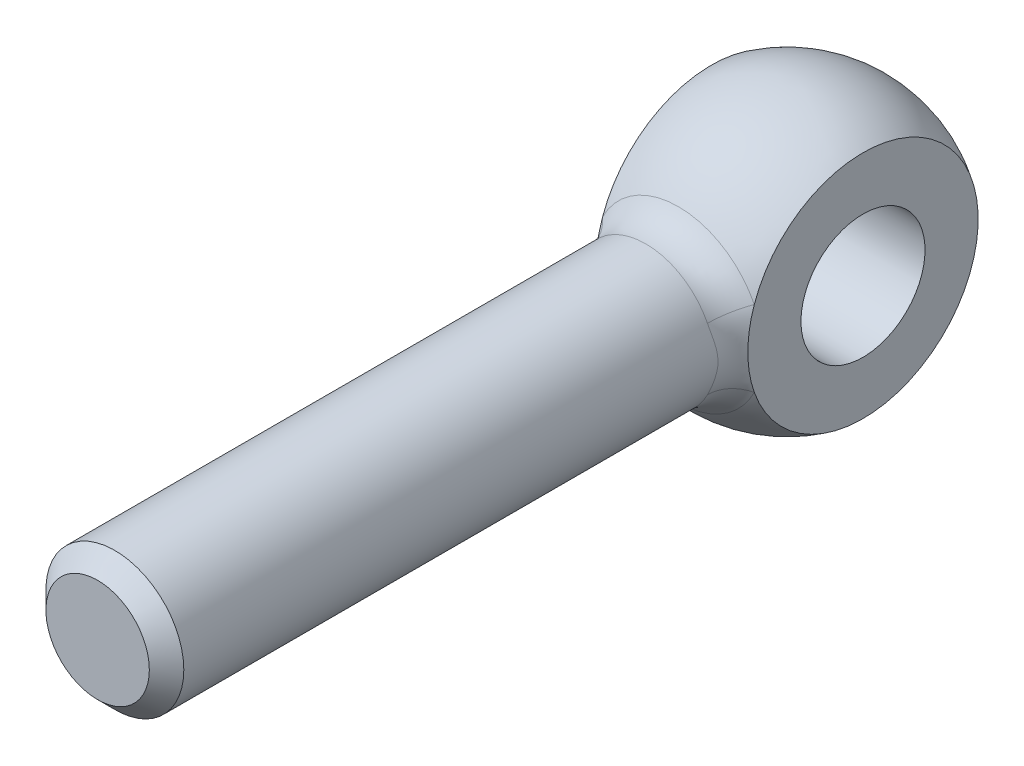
ISO-10303-21;
HEADER;
FILE_DESCRIPTION(('STEP AP214'),'2;1');
FILE_NAME('part.step','',(''),(''),'','','');
FILE_SCHEMA(('AUTOMOTIVE_DESIGN { 1 0 10303 214 1 1 1 1 }'));
ENDSEC;
DATA;
#1=APPLICATION_CONTEXT('core data for automotive mechanical design processes');
#2=APPLICATION_PROTOCOL_DEFINITION('international standard','automotive_design',2000,#1);
#3=PRODUCT_CONTEXT('',#1,'mechanical');
#4=PRODUCT('Part','Part','',(#3));
#5=PRODUCT_RELATED_PRODUCT_CATEGORY('part','',(#4));
#6=PRODUCT_DEFINITION_FORMATION('','',#4);
#7=PRODUCT_DEFINITION_CONTEXT('part definition',#1,'design');
#8=PRODUCT_DEFINITION('design','',#6,#7);
#9=PRODUCT_DEFINITION_SHAPE('','',#8);
#10=(LENGTH_UNIT() NAMED_UNIT(*) SI_UNIT(.MILLI.,.METRE.));
#11=(NAMED_UNIT(*) PLANE_ANGLE_UNIT() SI_UNIT($,.RADIAN.));
#12=(NAMED_UNIT(*) SI_UNIT($,.STERADIAN.) SOLID_ANGLE_UNIT());
#13=UNCERTAINTY_MEASURE_WITH_UNIT(LENGTH_MEASURE(1.E-05),#10,'distance_accuracy_value','');
#14=(GEOMETRIC_REPRESENTATION_CONTEXT(3) GLOBAL_UNCERTAINTY_ASSIGNED_CONTEXT((#13)) GLOBAL_UNIT_ASSIGNED_CONTEXT((#10,
#11,#12)) REPRESENTATION_CONTEXT('',''));
#15=CARTESIAN_POINT('',(0.,0.,0.));
#16=DIRECTION('',(0.,0.,1.));
#17=DIRECTION('',(1.,0.,0.));
#18=AXIS2_PLACEMENT_3D('',#15,#16,#17);
#19=CARTESIAN_POINT('',(0.,0.,0.));
#20=DIRECTION('',(-1.,0.,0.));
#21=DIRECTION('',(0.,0.,-1.));
#22=AXIS2_PLACEMENT_3D('',#19,#20,#21);
#23=SPHERICAL_SURFACE('',#22,20.);
#24=CARTESIAN_POINT('',(11.,0.,0.));
#25=DIRECTION('',(1.,0.,0.));
#26=DIRECTION('',(0.,0.,1.));
#27=AXIS2_PLACEMENT_3D('',#24,#25,#26);
#28=CIRCLE('',#27,16.70329308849);
#29=CARTESIAN_POINT('',(11.,5.52080518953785,15.7645396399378));
#30=VERTEX_POINT('',#29);
#31=CARTESIAN_POINT('',(11.,-5.52080518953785,15.7645396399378));
#32=VERTEX_POINT('',#31);
#33=EDGE_CURVE('E249',#30,#32,#28,.F.);
#34=ORIENTED_EDGE('',*,*,#33,.T.);
#35=CARTESIAN_POINT('',(0.,0.,15.7645396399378));
#36=DIRECTION('',(0.,0.,-1.));
#37=DIRECTION('',(-1.,0.,0.));
#38=AXIS2_PLACEMENT_3D('',#35,#36,#37);
#39=CIRCLE('',#38,12.3076923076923);
#40=CARTESIAN_POINT('',(-11.,-5.52080518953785,15.7645396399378));
#41=VERTEX_POINT('',#40);
#42=EDGE_CURVE('E72',#32,#41,#39,.T.);
#43=ORIENTED_EDGE('',*,*,#42,.T.);
#44=CARTESIAN_POINT('',(-11.,0.,0.));
#45=DIRECTION('',(1.,0.,0.));
#46=DIRECTION('',(0.,0.,1.));
#47=AXIS2_PLACEMENT_3D('',#44,#45,#46);
#48=CIRCLE('',#47,16.70329308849);
#49=CARTESIAN_POINT('',(-11.,5.52080518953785,15.7645396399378));
#50=VERTEX_POINT('',#49);
#51=EDGE_CURVE('E60',#50,#41,#48,.F.);
#52=ORIENTED_EDGE('',*,*,#51,.F.);
#53=CARTESIAN_POINT('',(0.,0.,15.7645396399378));
#54=DIRECTION('',(0.,0.,-1.));
#55=DIRECTION('',(-1.,0.,0.));
#56=AXIS2_PLACEMENT_3D('',#53,#54,#55);
#57=CIRCLE('',#56,12.3076923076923);
#58=EDGE_CURVE('E69',#50,#30,#57,.T.);
#59=ORIENTED_EDGE('',*,*,#58,.T.);
#60=EDGE_LOOP('',(#34,#43,#52,#59));
#61=FACE_BOUND('',#60,.T.);
#62=ADVANCED_FACE('F14',(#61),#23,.T.);
#63=CARTESIAN_POINT('',(0.,0.,-10.));
#64=DIRECTION('',(0.,0.,-1.));
#65=DIRECTION('',(1.,0.,0.));
#66=AXIS2_PLACEMENT_3D('',#63,#64,#65);
#67=CYLINDRICAL_SURFACE('',#66,10.);
#68=CARTESIAN_POINT('',(11.,8.07832617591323,14.6198716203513));
#69=CARTESIAN_POINT('',(8.08765754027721,5.99719772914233,16.1346741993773));
#70=CARTESIAN_POINT('',(7.28375150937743,6.85178545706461,19.8401938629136));
#71=CARTESIAN_POINT('',(11.,7.94371142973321,14.6942392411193));
#72=CARTESIAN_POINT('',(8.11920288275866,5.93544807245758,16.2397825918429));
#73=CARTESIAN_POINT('',(7.39683409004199,6.73162150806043,19.9238227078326));
#74=CARTESIAN_POINT('',(11.,7.80678494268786,14.7674864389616));
#75=CARTESIAN_POINT('',(8.15519367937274,5.8698319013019,16.3423149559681));
#76=CARTESIAN_POINT('',(7.50807818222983,6.60735770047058,19.9985173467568));
#77=CARTESIAN_POINT('',(11.,7.52777859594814,14.9116503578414));
#78=CARTESIAN_POINT('',(8.23492168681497,5.72986071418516,16.5404699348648));
#79=CARTESIAN_POINT('',(7.72578328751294,6.35140245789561,20.1309394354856));
#80=CARTESIAN_POINT('',(11.,7.38570047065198,14.9825678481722));
#81=CARTESIAN_POINT('',(8.27858235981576,5.65560014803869,16.6361171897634));
#82=CARTESIAN_POINT('',(7.83224588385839,6.21971351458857,20.1886725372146));
#83=CARTESIAN_POINT('',(11.,7.09641260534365,15.1217242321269));
#84=CARTESIAN_POINT('',(8.37244720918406,5.4973859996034,16.8193360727));
#85=CARTESIAN_POINT('',(8.03890108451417,5.95019585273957,20.2879075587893));
#86=CARTESIAN_POINT('',(11.,6.94922832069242,15.1899735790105));
#87=CARTESIAN_POINT('',(8.42255486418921,5.41357855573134,16.9069775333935));
#88=CARTESIAN_POINT('',(8.1391193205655,5.81239684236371,20.3294800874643));
#89=CARTESIAN_POINT('',(11.,6.64863682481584,15.3239259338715));
#90=CARTESIAN_POINT('',(8.52797993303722,5.23504745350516,17.0738797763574));
#91=CARTESIAN_POINT('',(8.33295854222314,5.53091179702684,20.3979224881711));
#92=CARTESIAN_POINT('',(11.,6.49523086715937,15.3896294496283));
#93=CARTESIAN_POINT('',(8.58324700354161,5.14042645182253,17.1531990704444));
#94=CARTESIAN_POINT('',(8.42658084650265,5.38722694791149,20.4247953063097));
#95=CARTESIAN_POINT('',(11.,6.20709411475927,15.5078088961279));
#96=CARTESIAN_POINT('',(8.68811994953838,4.95575537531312,17.2908288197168));
#97=CARTESIAN_POINT('',(8.59200338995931,5.11841729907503,20.4619167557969));
#98=CARTESIAN_POINT('',(11.,6.07336532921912,15.5607030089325));
#99=CARTESIAN_POINT('',(8.73711538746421,4.86761224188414,17.3504312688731));
#100=CARTESIAN_POINT('',(8.66488139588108,4.99405789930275,20.4741536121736));
#101=CARTESIAN_POINT('',(11.,5.80091130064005,15.6643118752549));
#102=CARTESIAN_POINT('',(8.83647568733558,4.68301353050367,17.4631108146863));
#103=CARTESIAN_POINT('',(8.80526889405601,4.74215537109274,20.4901477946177));
#104=CARTESIAN_POINT('',(11.,5.66218619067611,15.7150266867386));
#105=CARTESIAN_POINT('',(8.88683503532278,4.58660687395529,17.5162358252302));
#106=CARTESIAN_POINT('',(8.87277852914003,4.61461232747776,20.4939053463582));
#107=CARTESIAN_POINT('',(11.,5.2744874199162,15.8508024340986));
#108=CARTESIAN_POINT('',(9.02498244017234,4.31134076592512,17.6524759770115));
#109=CARTESIAN_POINT('',(9.05025948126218,4.26097993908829,20.4938948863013));
#110=CARTESIAN_POINT('',(11.,5.02010807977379,15.933417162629));
#111=CARTESIAN_POINT('',(9.1134168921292,4.12339116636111,17.7293699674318));
#112=CARTESIAN_POINT('',(9.15455589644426,4.03201043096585,20.482471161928));
#113=CARTESIAN_POINT('',(11.,4.49398867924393,16.0897301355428));
#114=CARTESIAN_POINT('',(9.2852606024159,3.7225223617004,17.8631716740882));
#115=CARTESIAN_POINT('',(9.3454636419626,3.56728408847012,20.4426249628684));
#116=CARTESIAN_POINT('',(11.,4.22223625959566,16.1634219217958));
#117=CARTESIAN_POINT('',(9.36879764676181,3.50966167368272,17.9203351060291));
#118=CARTESIAN_POINT('',(9.43206219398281,3.33152248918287,20.4141902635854));
#119=CARTESIAN_POINT('',(11.,3.65988605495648,16.2999751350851));
#120=CARTESIAN_POINT('',(9.52556401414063,3.06031940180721,18.0164117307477));
#121=CARTESIAN_POINT('',(9.58737307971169,2.8540318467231,20.3472388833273));
#122=CARTESIAN_POINT('',(11.,3.36923757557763,16.3628056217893));
#123=CARTESIAN_POINT('',(9.59896836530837,2.82367795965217,18.055508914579));
#124=CARTESIAN_POINT('',(9.65603459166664,2.61228792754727,20.3086941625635));
#125=CARTESIAN_POINT('',(11.,2.76973253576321,16.47487160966));
#126=CARTESIAN_POINT('',(9.7303273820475,2.33005694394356,18.1181298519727));
#127=CARTESIAN_POINT('',(9.77497001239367,2.12438390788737,20.2300406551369));
#128=CARTESIAN_POINT('',(11.,2.46087520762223,16.5241065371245));
#129=CARTESIAN_POINT('',(9.78851479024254,2.07279105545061,18.1418261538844));
#130=CARTESIAN_POINT('',(9.82524314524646,1.87822362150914,20.1899318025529));
#131=CARTESIAN_POINT('',(11.,1.97558099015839,16.5869215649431));
#132=CARTESIAN_POINT('',(9.8627242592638,1.66606653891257,18.1691299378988));
#133=CARTESIAN_POINT('',(9.88798469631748,1.49853407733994,20.1346921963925));
#134=CARTESIAN_POINT('',(11.,1.80486836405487,16.6064011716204));
#135=CARTESIAN_POINT('',(9.88572783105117,1.52271728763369,18.1769526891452));
#136=CARTESIAN_POINT('',(9.90713175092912,1.36624599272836,20.1166604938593));
#137=CARTESIAN_POINT('',(11.,1.45962748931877,16.6402989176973));
#138=CARTESIAN_POINT('',(9.92572316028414,1.2323607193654,18.1898667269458));
#139=CARTESIAN_POINT('',(9.94012224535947,1.1008390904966,20.0843097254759));
#140=CARTESIAN_POINT('',(11.,1.28509972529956,16.6547176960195));
#141=CARTESIAN_POINT('',(9.94274289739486,1.08526382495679,18.194968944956));
#142=CARTESIAN_POINT('',(9.95396635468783,0.967720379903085,20.0699901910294));
#143=CARTESIAN_POINT('',(11.,0.933265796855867,16.6781317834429));
#144=CARTESIAN_POINT('',(9.97034914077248,0.788518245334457,18.2029399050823));
#145=CARTESIAN_POINT('',(9.97630347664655,0.70091512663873,20.0463030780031));
#146=CARTESIAN_POINT('',(11.,0.755960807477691,16.6871293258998));
#147=CARTESIAN_POINT('',(9.98095837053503,0.638767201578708,18.2058159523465));
#148=CARTESIAN_POINT('',(9.98479869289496,0.567228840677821,20.0369334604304));
#149=CARTESIAN_POINT('',(11.,0.399779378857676,16.6994587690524));
#150=CARTESIAN_POINT('',(9.99548246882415,0.337908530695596,18.20969285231));
#151=CARTESIAN_POINT('',(9.99641148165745,0.299512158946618,20.024007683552));
#152=CARTESIAN_POINT('',(11.,0.220902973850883,16.7027907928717));
#153=CARTESIAN_POINT('',(9.99940850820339,0.186688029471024,18.2106967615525));
#154=CARTESIAN_POINT('',(9.99952917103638,0.165481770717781,20.0204513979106));
#155=CARTESIAN_POINT('',(11.,-0.136946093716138,16.7036898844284));
#156=CARTESIAN_POINT('',(10.0004672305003,-0.115727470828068,18.2109707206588));
#157=CARTESIAN_POINT('',(10.0003719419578,-0.102589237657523,20.0194964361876));
#158=CARTESIAN_POINT('',(11.,-0.315918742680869,16.7012576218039));
#159=CARTESIAN_POINT('',(9.99760151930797,-0.26703906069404,18.2102411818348));
#160=CARTESIAN_POINT('',(9.9980976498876,-0.236629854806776,20.0220970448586));
#161=CARTESIAN_POINT('',(11.,-0.672512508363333,16.6907025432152));
#162=CARTESIAN_POINT('',(9.98516890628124,-0.568286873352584,18.2069499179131));
#163=CARTESIAN_POINT('',(9.98816894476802,-0.504415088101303,20.0332017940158));
#164=CARTESIAN_POINT('',(11.,-0.850133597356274,16.6825796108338));
#165=CARTESIAN_POINT('',(9.97559239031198,-0.718336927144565,18.2043856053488));
#166=CARTESIAN_POINT('',(9.98051442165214,-0.638159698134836,20.0417060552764));
#167=CARTESIAN_POINT('',(11.,-1.20278271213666,16.6608685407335));
#168=CARTESIAN_POINT('',(9.94999783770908,-1.01586252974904,18.1971047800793));
#169=CARTESIAN_POINT('',(9.95985376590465,-0.905121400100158,20.063826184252));
#170=CARTESIAN_POINT('',(11.,-1.37780963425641,16.6472781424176));
#171=CARTESIAN_POINT('',(9.93395835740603,-1.16344227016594,18.1923815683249));
#172=CARTESIAN_POINT('',(9.94684541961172,-1.03833825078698,20.0774441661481));
#173=CARTESIAN_POINT('',(11.,-1.72418294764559,16.6149773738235));
#174=CARTESIAN_POINT('',(9.89585032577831,-1.45491369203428,18.1803094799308));
#175=CARTESIAN_POINT('',(9.91552061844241,-1.3039715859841,20.1086007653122));
#176=CARTESIAN_POINT('',(11.,-1.89552887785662,16.5962663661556));
#177=CARTESIAN_POINT('',(9.87375477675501,-1.59889725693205,18.1729504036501));
#178=CARTESIAN_POINT('',(9.89720350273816,-1.43638796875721,20.1261398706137));
#179=CARTESIAN_POINT('',(11.,-2.37500909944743,16.5365375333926));
#180=CARTESIAN_POINT('',(9.80319058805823,-2.00106700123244,18.1475319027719));
#181=CARTESIAN_POINT('',(9.83780774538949,-1.81042123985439,20.1794292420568));
#182=CARTESIAN_POINT('',(11.,-2.6779072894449,16.4899385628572));
#183=CARTESIAN_POINT('',(9.74810406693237,-2.25372442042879,18.1256509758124));
#184=CARTESIAN_POINT('',(9.79049373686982,-2.0509057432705,20.2181580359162));
#185=CARTESIAN_POINT('',(11.,-3.26643445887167,16.3835279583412));
#186=CARTESIAN_POINT('',(9.62321822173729,-2.7394442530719,18.0677502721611));
#187=CARTESIAN_POINT('',(9.67835774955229,-2.52772088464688,20.2950790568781));
#188=CARTESIAN_POINT('',(11.,-3.55206644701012,16.3237186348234));
#189=CARTESIAN_POINT('',(9.55320446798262,-2.97279590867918,18.0315791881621));
#190=CARTESIAN_POINT('',(9.61353883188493,-2.7640522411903,20.333271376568));
#191=CARTESIAN_POINT('',(11.,-4.10520079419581,16.1934500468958));
#192=CARTESIAN_POINT('',(9.40307308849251,-3.41694854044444,17.9425152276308));
#193=CARTESIAN_POINT('',(9.46676566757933,-3.23111087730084,20.4009956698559));
#194=CARTESIAN_POINT('',(11.,-4.37275328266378,16.1230221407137));
#195=CARTESIAN_POINT('',(9.32279049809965,-3.6279239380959,17.8894603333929));
#196=CARTESIAN_POINT('',(9.38486161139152,-3.4618524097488,20.430552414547));
#197=CARTESIAN_POINT('',(11.,-4.89128593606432,15.9733573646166));
#198=CARTESIAN_POINT('',(9.15681833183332,-4.02651224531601,17.7649594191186));
#199=CARTESIAN_POINT('',(9.20410009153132,-3.91720598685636,20.4744658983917));
#200=CARTESIAN_POINT('',(11.,-5.14226890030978,15.8941219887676));
#201=CARTESIAN_POINT('',(9.07099592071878,-4.21407941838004,17.6932699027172));
#202=CARTESIAN_POINT('',(9.10524550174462,-4.14181906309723,20.4888252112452));
#203=CARTESIAN_POINT('',(11.,-5.57948076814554,15.7452016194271));
#204=CARTESIAN_POINT('',(8.91675575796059,-4.52930004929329,17.5476124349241));
#205=CARTESIAN_POINT('',(8.91288683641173,-4.53858237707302,20.4959451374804));
#206=CARTESIAN_POINT('',(11.,-5.76853191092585,15.6768309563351));
#207=CARTESIAN_POINT('',(8.84816828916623,-4.66157604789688,17.4767712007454));
#208=CARTESIAN_POINT('',(8.82235160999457,-4.71214727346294,20.4924900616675));
#209=CARTESIAN_POINT('',(11.,-6.13738931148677,15.5361317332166));
#210=CARTESIAN_POINT('',(8.71360068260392,-4.91098552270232,17.3233243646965));
#211=CARTESIAN_POINT('',(8.63145758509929,-5.05332990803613,20.4699143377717));
#212=CARTESIAN_POINT('',(11.,-6.31719880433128,15.4638045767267));
#213=CARTESIAN_POINT('',(8.64763428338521,-5.02800230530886,17.2406040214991));
#214=CARTESIAN_POINT('',(8.53110226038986,-5.2209497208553,20.4507992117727));
#215=CARTESIAN_POINT('',(11.,-6.67039350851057,15.3147992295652));
#216=CARTESIAN_POINT('',(8.52017906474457,-5.24885941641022,17.062956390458));
#217=CARTESIAN_POINT('',(8.32005997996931,-5.55115938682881,20.3943977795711));
#218=CARTESIAN_POINT('',(11.,-6.84367796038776,15.2380797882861));
#219=CARTESIAN_POINT('',(8.45881409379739,-5.35236860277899,16.967804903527));
#220=CARTESIAN_POINT('',(8.20926514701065,-5.71366661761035,20.3568998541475));
#221=CARTESIAN_POINT('',(11.,-7.18254092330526,15.0813064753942));
#222=CARTESIAN_POINT('',(8.34361214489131,-5.54600465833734,16.7669351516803));
#223=CARTESIAN_POINT('',(7.97938823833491,-6.03058739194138,20.2617246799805));
#224=CARTESIAN_POINT('',(11.,-7.34810983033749,15.0012486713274));
#225=CARTESIAN_POINT('',(8.28987110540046,-5.63596246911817,16.6611306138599));
#226=CARTESIAN_POINT('',(7.86029627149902,-6.18499087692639,20.2040230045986));
#227=CARTESIAN_POINT('',(11.,-7.51010721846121,14.919728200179));
#228=CARTESIAN_POINT('',(8.24137694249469,-5.71943183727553,16.5511784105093));
#229=CARTESIAN_POINT('',(7.73770382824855,-6.3346617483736,20.1353038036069));
#230=(BOUNDED_SURFACE() B_SPLINE_SURFACE(3,2,((#68,#69,#70),(#71,#72,#73),(#74,#75,#76),(#77,
#78,#79),(#80,#81,#82),(#83,#84,#85),(#86,#87,#88),(#89,#90,#91),(#92,#93,#94),(#95,#96,#97),
(#98,#99,#100),(#101,#102,#103),(#104,#105,#106),(#107,#108,#109),(#110,#111,#112),(#113,#114,
#115),(#116,#117,#118),(#119,#120,#121),(#122,#123,#124),(#125,#126,#127),(#128,#129,#130),
(#131,#132,#133),(#134,#135,#136),(#137,#138,#139),(#140,#141,#142),(#143,#144,#145),(#146,#147,
#148),(#149,#150,#151),(#152,#153,#154),(#155,#156,#157),(#158,#159,#160),(#161,#162,#163),
(#164,#165,#166),(#167,#168,#169),(#170,#171,#172),(#173,#174,#175),(#176,#177,#178),(#179,#180,
#181),(#182,#183,#184),(#185,#186,#187),(#188,#189,#190),(#191,#192,#193),(#194,#195,#196),
(#197,#198,#199),(#200,#201,#202),(#203,#204,#205),(#206,#207,#208),(#209,#210,#211),(#212,#213,
#214),(#215,#216,#217),(#218,#219,#220),(#221,#222,#223),(#224,#225,#226),(#227,#228,#229)),
.UNSPECIFIED.,.F.,.F.,.F.) B_SPLINE_SURFACE_WITH_KNOTS((4,2,2,2,2,2,2,2,2,2,2,2,2,2,2,2,2,2,2,2,
2,2,2,2,2,2,4),(3,3),(0.,0.830487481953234,1.66069791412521,2.48723908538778,3.31361454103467,
4.00607990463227,4.69852683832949,5.90492644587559,7.11219405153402,8.32284604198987,
9.53354911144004,10.1772580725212,10.8208857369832,11.4642480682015,12.1075964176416,
12.7508700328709,13.3941568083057,14.0377098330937,14.6813430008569,15.8623569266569,
17.043164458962,18.2205508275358,19.3977377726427,20.336589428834,21.2751101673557,
22.224698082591,23.1754380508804),(0.,1.),
.UNSPECIFIED.) GEOMETRIC_REPRESENTATION_ITEM() RATIONAL_B_SPLINE_SURFACE(((1.,0.839284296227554,
1.),(1.,0.842507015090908,1.),(1.,0.845813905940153,1.),(1.,0.852563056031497,1.),(1.,
0.85600526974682,1.),(1.,0.862978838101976,1.),(1.,0.86650973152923,1.),(1.,0.873627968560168,
1.),(1.,0.877215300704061,1.),(1.,0.883811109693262,1.),(1.,0.886819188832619,1.),(1.,
0.892802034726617,1.),(1.,0.895776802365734,1.),(1.,0.903839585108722,1.),(1.,0.908857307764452,
1.),(1.,0.918479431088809,1.),(1.,0.923083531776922,1.),(1.,0.931678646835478,1.),(1.,
0.935667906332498,1.),(1.,0.942805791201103,1.),(1.,0.94595438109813,1.),(1.,0.949974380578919,
1.),(1.,0.95122168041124,1.),(1.,0.953392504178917,1.),(1.,0.954316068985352,1.),(1.,
0.955815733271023,1.),(1.,0.956391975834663,1.),(1.,0.957181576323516,1.),(1.,0.957394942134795,
1.),(1.,0.957452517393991,1.),(1.,0.957296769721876,1.),(1.,0.956620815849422,1.),(1.,
0.95610060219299,1.),(1.,0.954710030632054,1.),(1.,0.953839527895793,1.),(1.,0.951770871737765,
1.),(1.,0.950572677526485,1.),(1.,0.946749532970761,1.),(1.,0.943768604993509,1.),(1.,
0.936985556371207,1.),(1.,0.933183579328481,1.),(1.,0.924966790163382,1.),(1.,0.920553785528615,
1.),(1.,0.911300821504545,1.),(1.,0.906460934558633,1.),(1.,0.897549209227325,1.),(1.,
0.893520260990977,1.),(1.,0.885405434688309,1.),(1.,0.881319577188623,1.),(1.,0.873128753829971,
1.),(1.,0.869024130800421,1.),(1.,0.860913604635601,1.),(1.,0.856907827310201,1.),(1.,
0.852991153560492,1.))) REPRESENTATION_ITEM('') SURFACE());
#231=CARTESIAN_POINT('',(7.73770382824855,-6.3346617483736,20.1353038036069));
#232=CARTESIAN_POINT('',(7.86029627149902,-6.18499087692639,20.2040230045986));
#233=CARTESIAN_POINT('',(7.97938823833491,-6.03058739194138,20.2617246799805));
#234=CARTESIAN_POINT('',(8.20926514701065,-5.71366661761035,20.3568998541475));
#235=CARTESIAN_POINT('',(8.32005997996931,-5.55115938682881,20.3943977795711));
#236=CARTESIAN_POINT('',(8.53110226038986,-5.2209497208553,20.4507992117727));
#237=CARTESIAN_POINT('',(8.63145758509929,-5.05332990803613,20.4699143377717));
#238=CARTESIAN_POINT('',(8.82235160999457,-4.71214727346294,20.4924900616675));
#239=CARTESIAN_POINT('',(8.91288683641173,-4.53858237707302,20.4959451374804));
#240=CARTESIAN_POINT('',(9.10524550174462,-4.14181906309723,20.4888252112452));
#241=CARTESIAN_POINT('',(9.20410009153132,-3.91720598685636,20.4744658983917));
#242=CARTESIAN_POINT('',(9.38486161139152,-3.4618524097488,20.430552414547));
#243=CARTESIAN_POINT('',(9.46676566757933,-3.23111087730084,20.4009956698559));
#244=CARTESIAN_POINT('',(9.61353883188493,-2.7640522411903,20.333271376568));
#245=CARTESIAN_POINT('',(9.67835774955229,-2.52772088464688,20.2950790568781));
#246=CARTESIAN_POINT('',(9.79049373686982,-2.0509057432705,20.2181580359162));
#247=CARTESIAN_POINT('',(9.83780774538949,-1.81042123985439,20.1794292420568));
#248=CARTESIAN_POINT('',(9.89720350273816,-1.43638796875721,20.1261398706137));
#249=CARTESIAN_POINT('',(9.91552061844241,-1.3039715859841,20.1086007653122));
#250=CARTESIAN_POINT('',(9.94684541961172,-1.03833825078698,20.0774441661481));
#251=CARTESIAN_POINT('',(9.95985376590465,-0.905121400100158,20.063826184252));
#252=CARTESIAN_POINT('',(9.98051442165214,-0.638159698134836,20.0417060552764));
#253=CARTESIAN_POINT('',(9.98816894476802,-0.504415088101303,20.0332017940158));
#254=CARTESIAN_POINT('',(9.9980976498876,-0.236629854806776,20.0220970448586));
#255=CARTESIAN_POINT('',(10.0003719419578,-0.102589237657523,20.0194964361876));
#256=CARTESIAN_POINT('',(9.99952917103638,0.165481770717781,20.0204513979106));
#257=CARTESIAN_POINT('',(9.99641148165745,0.299512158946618,20.024007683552));
#258=CARTESIAN_POINT('',(9.98479869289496,0.567228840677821,20.0369334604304));
#259=CARTESIAN_POINT('',(9.97630347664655,0.70091512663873,20.0463030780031));
#260=CARTESIAN_POINT('',(9.95396635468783,0.967720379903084,20.0699901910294));
#261=CARTESIAN_POINT('',(9.94012224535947,1.1008390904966,20.0843097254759));
#262=CARTESIAN_POINT('',(9.90713175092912,1.36624599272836,20.1166604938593));
#263=CARTESIAN_POINT('',(9.88798469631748,1.49853407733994,20.1346921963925));
#264=CARTESIAN_POINT('',(9.82524314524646,1.87822362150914,20.1899318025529));
#265=CARTESIAN_POINT('',(9.77497001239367,2.12438390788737,20.2300406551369));
#266=CARTESIAN_POINT('',(9.65603459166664,2.61228792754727,20.3086941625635));
#267=CARTESIAN_POINT('',(9.58737307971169,2.8540318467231,20.3472388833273));
#268=CARTESIAN_POINT('',(9.43206219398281,3.33152248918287,20.4141902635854));
#269=CARTESIAN_POINT('',(9.3454636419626,3.56728408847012,20.4426249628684));
#270=CARTESIAN_POINT('',(9.15455589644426,4.03201043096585,20.482471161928));
#271=CARTESIAN_POINT('',(9.05025948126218,4.26097993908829,20.4938948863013));
#272=CARTESIAN_POINT('',(8.87277852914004,4.61461232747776,20.4939053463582));
#273=CARTESIAN_POINT('',(8.80526889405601,4.74215537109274,20.4901477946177));
#274=CARTESIAN_POINT('',(8.66488139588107,4.99405789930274,20.4741536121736));
#275=CARTESIAN_POINT('',(8.59200338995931,5.11841729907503,20.4619167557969));
#276=CARTESIAN_POINT('',(8.42658084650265,5.38722694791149,20.4247953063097));
#277=CARTESIAN_POINT('',(8.33295854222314,5.53091179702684,20.3979224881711));
#278=CARTESIAN_POINT('',(8.1391193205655,5.81239684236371,20.3294800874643));
#279=CARTESIAN_POINT('',(8.03890108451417,5.95019585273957,20.2879075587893));
#280=CARTESIAN_POINT('',(7.83224588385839,6.21971351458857,20.1886725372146));
#281=CARTESIAN_POINT('',(7.72578328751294,6.35140245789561,20.1309394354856));
#282=CARTESIAN_POINT('',(7.50807818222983,6.60735770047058,19.9985173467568));
#283=CARTESIAN_POINT('',(7.39683409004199,6.73162150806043,19.9238227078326));
#284=CARTESIAN_POINT('',(7.28375150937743,6.85178545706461,19.8401938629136));
#285=B_SPLINE_CURVE_WITH_KNOTS('',3,(#231,#232,#233,#234,#235,#236,#237,#238,#239,#240,#241,
#242,#243,#244,#245,#246,#247,#248,#249,#250,#251,#252,#253,#254,#255,#256,#257,#258,#259,#260,
#261,#262,#263,#264,#265,#266,#267,#268,#269,#270,#271,#272,#273,#274,#275,#276,#277,#278,#279,
#280,#281,#282,#283,#284),.UNSPECIFIED.,.F.,.F.,(4,2,2,2,2,2,2,2,2,2,2,2,2,2,2,2,2,2,2,2,2,2,2,
2,2,2,4),(0.,0.950739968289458,1.90032788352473,2.8388486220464,3.77770027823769,
4.95488722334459,6.13227359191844,7.31308112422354,8.49409505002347,9.13772821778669,
9.7812812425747,10.4245680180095,11.0678416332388,11.711189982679,12.3545523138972,
12.9981799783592,13.6418889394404,14.8525920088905,16.0632439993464,17.2705116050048,
18.4769112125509,19.1693581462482,19.8618235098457,20.6881989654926,21.5147401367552,
22.3449505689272,23.1754380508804),.UNSPECIFIED.);
#286=CARTESIAN_POINT('',(8.9375,-4.4856542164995,20.4939015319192));
#287=VERTEX_POINT('',#286);
#288=CARTESIAN_POINT('',(8.9375,4.48565421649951,20.4939015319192));
#289=VERTEX_POINT('',#288);
#290=EDGE_CURVE('E85',#287,#289,#285,.T.);
#291=ORIENTED_EDGE('',*,*,#290,.T.);
#292=CARTESIAN_POINT('',(0.,0.,20.4939015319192));
#293=DIRECTION('',(0.,0.,-1.));
#294=DIRECTION('',(-1.,0.,0.));
#295=AXIS2_PLACEMENT_3D('',#292,#293,#294);
#296=CIRCLE('',#295,10.);
#297=CARTESIAN_POINT('',(-8.9375,4.4856542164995,20.4939015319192));
#298=VERTEX_POINT('',#297);
#299=EDGE_CURVE('E9',#289,#298,#296,.F.);
#300=ORIENTED_EDGE('',*,*,#299,.T.);
#301=CARTESIAN_POINT('',(-11.,-8.07832621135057,14.6198716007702));
#302=CARTESIAN_POINT('',(-8.08765753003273,-5.9971977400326,16.1346741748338));
#303=CARTESIAN_POINT('',(-7.28375150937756,-6.85178545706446,19.8401938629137));
#304=CARTESIAN_POINT('',(-11.,-7.94371144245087,14.6942392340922));
#305=CARTESIAN_POINT('',(-8.11920287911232,-5.93544807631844,16.2397825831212));
#306=CARTESIAN_POINT('',(-7.39683409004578,-6.73162150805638,19.9238227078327));
#307=CARTESIAN_POINT('',(-11.,-7.80678494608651,14.7674864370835));
#308=CARTESIAN_POINT('',(-8.15519367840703,-5.86983190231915,16.3423149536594));
#309=CARTESIAN_POINT('',(-7.50807818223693,-6.60735770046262,19.9985173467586));
#310=CARTESIAN_POINT('',(-11.,-7.52777859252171,14.9116503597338));
#311=CARTESIAN_POINT('',(-8.23492168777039,-5.72986071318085,16.5404699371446));
#312=CARTESIAN_POINT('',(-7.72578328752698,-6.35140245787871,20.1309394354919));
#313=CARTESIAN_POINT('',(-11.,-7.38570046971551,14.9825678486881));
#314=CARTESIAN_POINT('',(-8.27858236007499,-5.65560014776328,16.6361171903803));
#315=CARTESIAN_POINT('',(-7.83224588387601,-6.21971351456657,20.1886725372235));
#316=CARTESIAN_POINT('',(-11.,-7.09641260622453,15.121724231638));
#317=CARTESIAN_POINT('',(-8.37244720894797,-5.49738599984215,16.8193360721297));
#318=CARTESIAN_POINT('',(-8.03890108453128,-5.9501958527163,20.2879075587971));
#319=CARTESIAN_POINT('',(-11.,-6.94922832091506,15.1899735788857));
#320=CARTESIAN_POINT('',(-8.42255486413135,-5.41357855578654,16.9069775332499));
#321=CARTESIAN_POINT('',(-8.13911932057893,-5.81239684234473,20.3294800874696));
#322=CARTESIAN_POINT('',(-11.,-6.6486368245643,15.3239259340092));
#323=CARTESIAN_POINT('',(-8.52797993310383,-5.23504745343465,17.0738797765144));
#324=CARTESIAN_POINT('',(-8.33295854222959,-5.53091179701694,20.3979224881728));
#325=CARTESIAN_POINT('',(-11.,-6.49523086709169,15.3896294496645));
#326=CARTESIAN_POINT('',(-8.58324700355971,-5.14042645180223,17.1531990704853));
#327=CARTESIAN_POINT('',(-8.42658084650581,-5.38722694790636,20.4247953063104));
#328=CARTESIAN_POINT('',(-11.,-6.20709411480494,15.5078088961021));
#329=CARTESIAN_POINT('',(-8.68811994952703,-4.95575537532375,17.290828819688));
#330=CARTESIAN_POINT('',(-8.5920033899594,-5.11841729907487,20.4619167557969));
#331=CARTESIAN_POINT('',(-11.,-6.0733653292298,15.5607030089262));
#332=CARTESIAN_POINT('',(-8.73711538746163,-4.86761224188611,17.350431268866));
#333=CARTESIAN_POINT('',(-8.66488139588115,-4.99405789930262,20.4741536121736));
#334=CARTESIAN_POINT('',(-11.,-5.80091130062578,15.6643118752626));
#335=CARTESIAN_POINT('',(-8.83647568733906,-4.68301353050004,17.4631108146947));
#336=CARTESIAN_POINT('',(-8.80526889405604,-4.74215537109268,20.4901477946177));
#337=CARTESIAN_POINT('',(-11.,-5.66218619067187,15.7150266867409));
#338=CARTESIAN_POINT('',(-8.8868350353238,-4.58660687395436,17.5162358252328));
#339=CARTESIAN_POINT('',(-8.87277852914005,-4.61461232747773,20.4939053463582));
#340=CARTESIAN_POINT('',(-11.,-5.27448741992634,15.8508024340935));
#341=CARTESIAN_POINT('',(-9.02498244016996,-4.31134076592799,17.6524759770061));
#342=CARTESIAN_POINT('',(-9.05025948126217,-4.26097993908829,20.4938948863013));
#343=CARTESIAN_POINT('',(-11.,-5.02010807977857,15.933417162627));
#344=CARTESIAN_POINT('',(-9.11341689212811,-4.12339116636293,17.7293699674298));
#345=CARTESIAN_POINT('',(-9.15455589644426,-4.03201043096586,20.482471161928));
#346=CARTESIAN_POINT('',(-11.,-4.49398867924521,16.089730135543));
#347=CARTESIAN_POINT('',(-9.28526060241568,-3.72252236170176,17.8631716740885));
#348=CARTESIAN_POINT('',(-9.3454636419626,-3.56728408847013,20.4426249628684));
#349=CARTESIAN_POINT('',(-11.,-4.22223625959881,16.1634219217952));
#350=CARTESIAN_POINT('',(-9.36879764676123,-3.50966167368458,17.9203351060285));
#351=CARTESIAN_POINT('',(-9.43206219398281,-3.33152248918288,20.4141902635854));
#352=CARTESIAN_POINT('',(-11.,-3.65988605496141,16.2999751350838));
#353=CARTESIAN_POINT('',(-9.52556401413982,-3.06031940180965,18.0164117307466));
#354=CARTESIAN_POINT('',(-9.58737307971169,-2.85403184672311,20.3472388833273));
#355=CARTESIAN_POINT('',(-11.,-3.36923757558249,16.3628056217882));
#356=CARTESIAN_POINT('',(-9.59896836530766,-2.82367795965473,18.0555089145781));
#357=CARTESIAN_POINT('',(-9.65603459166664,-2.61228792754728,20.3086941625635));
#358=CARTESIAN_POINT('',(-11.,-2.76973253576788,16.4748716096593));
#359=CARTESIAN_POINT('',(-9.73032738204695,-2.33005694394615,18.1181298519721));
#360=CARTESIAN_POINT('',(-9.77497001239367,-2.12438390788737,20.2300406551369));
#361=CARTESIAN_POINT('',(-11.,-2.46087520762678,16.5241065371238));
#362=CARTESIAN_POINT('',(-9.78851479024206,-2.07279105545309,18.1418261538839));
#363=CARTESIAN_POINT('',(-9.82524314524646,-1.87822362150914,20.1899318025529));
#364=CARTESIAN_POINT('',(-11.,-1.97558099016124,16.5869215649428));
#365=CARTESIAN_POINT('',(-9.86272425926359,-1.66606653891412,18.1691299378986));
#366=CARTESIAN_POINT('',(-9.88798469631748,-1.49853407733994,20.1346921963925));
#367=CARTESIAN_POINT('',(-11.,-1.80486836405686,16.6064011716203));
#368=CARTESIAN_POINT('',(-9.88572783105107,-1.52271728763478,18.176952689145));
#369=CARTESIAN_POINT('',(-9.90713175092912,-1.36624599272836,20.1166604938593));
#370=CARTESIAN_POINT('',(-11.,-1.45962748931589,16.6402989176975));
#371=CARTESIAN_POINT('',(-9.9257231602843,-1.23236071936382,18.189866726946));
#372=CARTESIAN_POINT('',(-9.94012224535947,-1.10083909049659,20.0843097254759));
#373=CARTESIAN_POINT('',(-11.,-1.28509972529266,16.6547176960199));
#374=CARTESIAN_POINT('',(-9.94274289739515,-1.08526382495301,18.1949689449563));
#375=CARTESIAN_POINT('',(-9.95396635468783,-0.967720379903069,20.0699901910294));
#376=CARTESIAN_POINT('',(-11.,-0.933265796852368,16.6781317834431));
#377=CARTESIAN_POINT('',(-9.97034914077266,-0.788518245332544,18.2029399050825));
#378=CARTESIAN_POINT('',(-9.97630347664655,-0.700915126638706,20.0463030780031));
#379=CARTESIAN_POINT('',(-11.,-0.755960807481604,16.6871293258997));
#380=CARTESIAN_POINT('',(-9.98095837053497,-0.638767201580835,18.2058159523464));
#381=CARTESIAN_POINT('',(-9.98479869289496,-0.567228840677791,20.0369334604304));
#382=CARTESIAN_POINT('',(-11.,-0.399779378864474,16.6994587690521));
#383=CARTESIAN_POINT('',(-9.99548246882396,-0.337908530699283,18.2096928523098));
#384=CARTESIAN_POINT('',(-9.99641148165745,-0.29951215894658,20.024007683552));
#385=CARTESIAN_POINT('',(-11.,-0.220902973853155,16.7027907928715));
#386=CARTESIAN_POINT('',(-9.99940850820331,-0.186688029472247,18.2106967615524));
#387=CARTESIAN_POINT('',(-9.99952917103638,-0.165481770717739,20.0204513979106));
#388=CARTESIAN_POINT('',(-11.,0.136946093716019,16.7036898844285));
#389=CARTESIAN_POINT('',(-10.0004672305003,0.115727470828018,18.2109707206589));
#390=CARTESIAN_POINT('',(-10.0003719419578,0.102589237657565,20.0194964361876));
#391=CARTESIAN_POINT('',(-11.,0.315918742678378,16.701257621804));
#392=CARTESIAN_POINT('',(-9.99760151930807,0.267039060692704,18.2102411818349));
#393=CARTESIAN_POINT('',(-9.9980976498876,0.236629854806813,20.0220970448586));
#394=CARTESIAN_POINT('',(-11.,0.672512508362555,16.6907025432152));
#395=CARTESIAN_POINT('',(-9.98516890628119,0.568286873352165,18.206949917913));
#396=CARTESIAN_POINT('',(-9.98816894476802,0.504415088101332,20.0332017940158));
#397=CARTESIAN_POINT('',(-11.,0.850133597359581,16.6825796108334));
#398=CARTESIAN_POINT('',(-9.97559239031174,0.718336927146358,18.2043856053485));
#399=CARTESIAN_POINT('',(-9.98051442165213,0.638159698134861,20.0417060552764));
#400=CARTESIAN_POINT('',(-11.,1.20278271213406,16.6608685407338));
#401=CARTESIAN_POINT('',(-9.94999783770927,1.01586252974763,18.1971047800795));
#402=CARTESIAN_POINT('',(-9.95985376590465,0.905121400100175,20.063826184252));
#403=CARTESIAN_POINT('',(-11.,1.3778096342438,16.6472781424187));
#404=CARTESIAN_POINT('',(-9.93395835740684,1.16344227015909,18.1923815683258));
#405=CARTESIAN_POINT('',(-9.94684541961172,1.03833825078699,20.0774441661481));
#406=CARTESIAN_POINT('',(-11.,1.72418294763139,16.6149773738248));
#407=CARTESIAN_POINT('',(-9.89585032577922,1.45491369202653,18.1803094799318));
#408=CARTESIAN_POINT('',(-9.91552061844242,1.3039715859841,20.1086007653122));
#409=CARTESIAN_POINT('',(-11.,1.89552887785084,16.5962663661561));
#410=CARTESIAN_POINT('',(-9.87375477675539,1.59889725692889,18.1729504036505));
#411=CARTESIAN_POINT('',(-9.89720350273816,1.43638796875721,20.1261398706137));
#412=CARTESIAN_POINT('',(-11.,2.37500909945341,16.5365375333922));
#413=CARTESIAN_POINT('',(-9.80319058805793,2.00106700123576,18.1475319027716));
#414=CARTESIAN_POINT('',(-9.83780774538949,1.81042123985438,20.1794292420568));
#415=CARTESIAN_POINT('',(-11.,2.67790728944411,16.4899385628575));
#416=CARTESIAN_POINT('',(-9.74810406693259,2.25372442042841,18.1256509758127));
#417=CARTESIAN_POINT('',(-9.79049373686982,2.05090574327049,20.2181580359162));
#418=CARTESIAN_POINT('',(-11.,3.26643445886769,16.3835279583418));
#419=CARTESIAN_POINT('',(-9.62321822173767,2.73944425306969,18.0677502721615));
#420=CARTESIAN_POINT('',(-9.67835774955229,2.52772088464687,20.2950790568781));
#421=CARTESIAN_POINT('',(-11.,3.55206644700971,16.3237186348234));
#422=CARTESIAN_POINT('',(-9.55320446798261,2.97279590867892,18.031579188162));
#423=CARTESIAN_POINT('',(-9.61353883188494,2.76405224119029,20.333271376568));
#424=CARTESIAN_POINT('',(-11.,4.10520079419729,16.1934500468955));
#425=CARTESIAN_POINT('',(-9.40307308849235,3.41694854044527,17.9425152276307));
#426=CARTESIAN_POINT('',(-9.46676566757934,3.23111087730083,20.4009956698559));
#427=CARTESIAN_POINT('',(-11.,4.37275328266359,16.1230221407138));
#428=CARTESIAN_POINT('',(-9.32279049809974,3.62792393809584,17.889460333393));
#429=CARTESIAN_POINT('',(-9.38486161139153,3.46185240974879,20.430552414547));
#430=CARTESIAN_POINT('',(-11.,4.89128593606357,15.9733573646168));
#431=CARTESIAN_POINT('',(-9.15681833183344,4.02651224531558,17.7649594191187));
#432=CARTESIAN_POINT('',(-9.20410009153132,3.91720598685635,20.4744658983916));
#433=CARTESIAN_POINT('',(-11.,5.14226890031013,15.8941219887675));
#434=CARTESIAN_POINT('',(-9.07099592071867,4.21407941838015,17.693269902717));
#435=CARTESIAN_POINT('',(-9.10524550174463,4.14181906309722,20.4888252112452));
#436=CARTESIAN_POINT('',(-11.,5.57948076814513,15.7452016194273));
#437=CARTESIAN_POINT('',(-8.91675575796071,4.52930004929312,17.5476124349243));
#438=CARTESIAN_POINT('',(-8.91288683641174,4.53858237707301,20.4959451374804));
#439=CARTESIAN_POINT('',(-11.,5.76853191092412,15.6768309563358));
#440=CARTESIAN_POINT('',(-8.8481682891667,4.66157604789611,17.4767712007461));
#441=CARTESIAN_POINT('',(-8.82235160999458,4.71214727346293,20.4924900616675));
#442=CARTESIAN_POINT('',(-11.,6.13738931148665,15.5361317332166));
#443=CARTESIAN_POINT('',(-8.71360068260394,4.91098552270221,17.3233243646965));
#444=CARTESIAN_POINT('',(-8.6314575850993,5.05332990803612,20.4699143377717));
#445=CARTESIAN_POINT('',(-11.,6.31719880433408,15.4638045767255));
#446=CARTESIAN_POINT('',(-8.64763428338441,5.02800230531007,17.2406040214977));
#447=CARTESIAN_POINT('',(-8.53110226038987,5.22094972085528,20.4507992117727));
#448=CARTESIAN_POINT('',(-11.,6.67039350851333,15.3147992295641));
#449=CARTESIAN_POINT('',(-8.52017906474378,5.24885941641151,17.0629563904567));
#450=CARTESIAN_POINT('',(-8.32005997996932,5.5511593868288,20.3943977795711));
#451=CARTESIAN_POINT('',(-11.,6.84367796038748,15.2380797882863));
#452=CARTESIAN_POINT('',(-8.45881409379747,5.35236860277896,16.9678049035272));
#453=CARTESIAN_POINT('',(-8.20926514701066,5.71366661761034,20.3568998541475));
#454=CARTESIAN_POINT('',(-11.,7.18254092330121,15.0813064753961));
#455=CARTESIAN_POINT('',(-8.34361214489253,5.54600465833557,16.7669351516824));
#456=CARTESIAN_POINT('',(-7.97938823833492,6.03058739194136,20.2617246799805));
#457=CARTESIAN_POINT('',(-11.,7.34810983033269,15.0012486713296));
#458=CARTESIAN_POINT('',(-8.28987110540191,5.63596246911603,16.6611306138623));
#459=CARTESIAN_POINT('',(-7.86029627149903,6.18499087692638,20.2040230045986));
#460=CARTESIAN_POINT('',(-11.,7.510107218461,14.9197282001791));
#461=CARTESIAN_POINT('',(-8.24137694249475,5.71943183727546,16.5511784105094));
#462=CARTESIAN_POINT('',(-7.73770382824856,6.33466174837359,20.1353038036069));
#463=(BOUNDED_SURFACE() B_SPLINE_SURFACE(3,2,((#301,#302,#303),(#304,#305,#306),(#307,#308,
#309),(#310,#311,#312),(#313,#314,#315),(#316,#317,#318),(#319,#320,#321),(#322,#323,#324),
(#325,#326,#327),(#328,#329,#330),(#331,#332,#333),(#334,#335,#336),(#337,#338,#339),(#340,#341,
#342),(#343,#344,#345),(#346,#347,#348),(#349,#350,#351),(#352,#353,#354),(#355,#356,#357),
(#358,#359,#360),(#361,#362,#363),(#364,#365,#366),(#367,#368,#369),(#370,#371,#372),(#373,#374,
#375),(#376,#377,#378),(#379,#380,#381),(#382,#383,#384),(#385,#386,#387),(#388,#389,#390),
(#391,#392,#393),(#394,#395,#396),(#397,#398,#399),(#400,#401,#402),(#403,#404,#405),(#406,#407,
#408),(#409,#410,#411),(#412,#413,#414),(#415,#416,#417),(#418,#419,#420),(#421,#422,#423),
(#424,#425,#426),(#427,#428,#429),(#430,#431,#432),(#433,#434,#435),(#436,#437,#438),(#439,#440,
#441),(#442,#443,#444),(#445,#446,#447),(#448,#449,#450),(#451,#452,#453),(#454,#455,#456),
(#457,#458,#459),(#460,#461,#462)),.UNSPECIFIED.,.F.,.F.,.F.) B_SPLINE_SURFACE_WITH_KNOTS((4,2,
2,2,2,2,2,2,2,2,2,2,2,2,2,2,2,2,2,2,2,2,2,2,2,2,4),(3,3),(0.,0.830487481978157,1.66069791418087,
2.48723908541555,3.31361454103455,4.00607990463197,4.69852683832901,5.9049264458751,
7.11219405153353,8.32284604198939,9.53354911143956,10.1772580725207,10.8208857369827,
11.464248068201,12.1075964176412,12.7508700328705,13.3941568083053,14.0377098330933,
14.6813430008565,15.8623569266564,17.0431644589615,18.2205508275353,19.3977377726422,
20.3365894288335,21.2751101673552,22.2246980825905,23.1754380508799),(0.,1.),
.UNSPECIFIED.) GEOMETRIC_REPRESENTATION_ITEM() RATIONAL_B_SPLINE_SURFACE(((1.,0.839284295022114,
1.),(1.,0.842507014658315,1.),(1.,0.845813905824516,1.),(1.,0.852563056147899,1.),(1.,
0.85600526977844,1.),(1.,0.862978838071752,1.),(1.,0.866509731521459,1.),(1.,0.873627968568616,
1.),(1.,0.87721530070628,1.),(1.,0.88381110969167,1.),(1.,0.886819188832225,1.),(1.,
0.892802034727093,1.),(1.,0.895776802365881,1.),(1.,0.903839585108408,1.),(1.,0.908857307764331,
1.),(1.,0.918479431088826,1.),(1.,0.923083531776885,1.),(1.,0.931678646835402,1.),(1.,
0.935667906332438,1.),(1.,0.942805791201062,1.),(1.,0.945954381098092,1.),(1.,0.949974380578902,
1.),(1.,0.951221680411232,1.),(1.,0.95339250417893,1.),(1.,0.954316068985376,1.),(1.,
0.955815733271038,1.),(1.,0.956391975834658,1.),(1.,0.957181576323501,1.),(1.,0.957394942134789,
1.),(1.,0.957452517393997,1.),(1.,0.957296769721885,1.),(1.,0.956620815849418,1.),(1.,
0.956100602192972,1.),(1.,0.95471003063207,1.),(1.,0.953839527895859,1.),(1.,0.951770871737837,
1.),(1.,0.950572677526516,1.),(1.,0.946749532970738,1.),(1.,0.943768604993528,1.),(1.,
0.936985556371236,1.),(1.,0.933183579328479,1.),(1.,0.92496679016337,1.),(1.,0.920553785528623,
1.),(1.,0.911300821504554,1.),(1.,0.906460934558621,1.),(1.,0.897549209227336,1.),(1.,
0.89352026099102,1.),(1.,0.885405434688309,1.),(1.,0.881319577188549,1.),(1.,0.873128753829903,
1.),(1.,0.869024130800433,1.),(1.,0.860913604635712,1.),(1.,0.85690782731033,1.),(1.,
0.852991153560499,1.))) REPRESENTATION_ITEM('') SURFACE());
#464=CARTESIAN_POINT('',(-7.73770382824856,6.33466174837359,20.1353038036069));
#465=CARTESIAN_POINT('',(-7.86029627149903,6.18499087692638,20.2040230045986));
#466=CARTESIAN_POINT('',(-7.97938823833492,6.03058739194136,20.2617246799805));
#467=CARTESIAN_POINT('',(-8.20926514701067,5.71366661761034,20.3568998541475));
#468=CARTESIAN_POINT('',(-8.32005997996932,5.5511593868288,20.3943977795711));
#469=CARTESIAN_POINT('',(-8.53110226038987,5.22094972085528,20.4507992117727));
#470=CARTESIAN_POINT('',(-8.6314575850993,5.05332990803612,20.4699143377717));
#471=CARTESIAN_POINT('',(-8.82235160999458,4.71214727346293,20.4924900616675));
#472=CARTESIAN_POINT('',(-8.91288683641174,4.53858237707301,20.4959451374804));
#473=CARTESIAN_POINT('',(-9.10524550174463,4.14181906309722,20.4888252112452));
#474=CARTESIAN_POINT('',(-9.20410009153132,3.91720598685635,20.4744658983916));
#475=CARTESIAN_POINT('',(-9.38486161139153,3.46185240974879,20.430552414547));
#476=CARTESIAN_POINT('',(-9.46676566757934,3.23111087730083,20.4009956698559));
#477=CARTESIAN_POINT('',(-9.61353883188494,2.76405224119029,20.333271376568));
#478=CARTESIAN_POINT('',(-9.67835774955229,2.52772088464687,20.2950790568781));
#479=CARTESIAN_POINT('',(-9.79049373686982,2.0509057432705,20.2181580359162));
#480=CARTESIAN_POINT('',(-9.83780774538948,1.81042123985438,20.1794292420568));
#481=CARTESIAN_POINT('',(-9.89720350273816,1.43638796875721,20.1261398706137));
#482=CARTESIAN_POINT('',(-9.91552061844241,1.3039715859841,20.1086007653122));
#483=CARTESIAN_POINT('',(-9.94684541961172,1.03833825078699,20.0774441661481));
#484=CARTESIAN_POINT('',(-9.95985376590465,0.905121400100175,20.063826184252));
#485=CARTESIAN_POINT('',(-9.98051442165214,0.63815969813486,20.0417060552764));
#486=CARTESIAN_POINT('',(-9.98816894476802,0.504415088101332,20.0332017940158));
#487=CARTESIAN_POINT('',(-9.9980976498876,0.236629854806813,20.0220970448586));
#488=CARTESIAN_POINT('',(-10.0003719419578,0.102589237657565,20.0194964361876));
#489=CARTESIAN_POINT('',(-9.99952917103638,-0.165481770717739,20.0204513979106));
#490=CARTESIAN_POINT('',(-9.99641148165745,-0.29951215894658,20.024007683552));
#491=CARTESIAN_POINT('',(-9.98479869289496,-0.567228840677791,20.0369334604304));
#492=CARTESIAN_POINT('',(-9.97630347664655,-0.700915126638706,20.0463030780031));
#493=CARTESIAN_POINT('',(-9.95396635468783,-0.967720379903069,20.0699901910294));
#494=CARTESIAN_POINT('',(-9.94012224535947,-1.10083909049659,20.0843097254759));
#495=CARTESIAN_POINT('',(-9.90713175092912,-1.36624599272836,20.1166604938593));
#496=CARTESIAN_POINT('',(-9.88798469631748,-1.49853407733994,20.1346921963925));
#497=CARTESIAN_POINT('',(-9.82524314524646,-1.87822362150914,20.1899318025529));
#498=CARTESIAN_POINT('',(-9.77497001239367,-2.12438390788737,20.2300406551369));
#499=CARTESIAN_POINT('',(-9.65603459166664,-2.61228792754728,20.3086941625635));
#500=CARTESIAN_POINT('',(-9.58737307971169,-2.85403184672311,20.3472388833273));
#501=CARTESIAN_POINT('',(-9.43206219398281,-3.33152248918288,20.4141902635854));
#502=CARTESIAN_POINT('',(-9.3454636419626,-3.56728408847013,20.4426249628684));
#503=CARTESIAN_POINT('',(-9.15455589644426,-4.03201043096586,20.482471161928));
#504=CARTESIAN_POINT('',(-9.05025948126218,-4.26097993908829,20.4938948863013));
#505=CARTESIAN_POINT('',(-8.87277852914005,-4.61461232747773,20.4939053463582));
#506=CARTESIAN_POINT('',(-8.80526889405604,-4.74215537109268,20.4901477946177));
#507=CARTESIAN_POINT('',(-8.66488139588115,-4.99405789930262,20.4741536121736));
#508=CARTESIAN_POINT('',(-8.5920033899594,-5.11841729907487,20.4619167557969));
#509=CARTESIAN_POINT('',(-8.42658084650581,-5.38722694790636,20.4247953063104));
#510=CARTESIAN_POINT('',(-8.33295854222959,-5.53091179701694,20.3979224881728));
#511=CARTESIAN_POINT('',(-8.13911932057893,-5.81239684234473,20.3294800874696));
#512=CARTESIAN_POINT('',(-8.03890108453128,-5.9501958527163,20.2879075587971));
#513=CARTESIAN_POINT('',(-7.83224588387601,-6.21971351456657,20.1886725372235));
#514=CARTESIAN_POINT('',(-7.72578328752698,-6.35140245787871,20.1309394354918));
#515=CARTESIAN_POINT('',(-7.50807818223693,-6.60735770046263,19.9985173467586));
#516=CARTESIAN_POINT('',(-7.39683409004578,-6.73162150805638,19.9238227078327));
#517=CARTESIAN_POINT('',(-7.28375150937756,-6.85178545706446,19.8401938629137));
#518=B_SPLINE_CURVE_WITH_KNOTS('',3,(#464,#465,#466,#467,#468,#469,#470,#471,#472,#473,#474,
#475,#476,#477,#478,#479,#480,#481,#482,#483,#484,#485,#486,#487,#488,#489,#490,#491,#492,#493,
#494,#495,#496,#497,#498,#499,#500,#501,#502,#503,#504,#505,#506,#507,#508,#509,#510,#511,#512,
#513,#514,#515,#516,#517),.UNSPECIFIED.,.F.,.F.,(4,2,2,2,2,2,2,2,2,2,2,2,2,2,2,2,2,2,2,2,2,2,2,
2,2,2,4),(0.,0.950739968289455,1.90032788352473,2.83884862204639,3.77770027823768,
4.95488722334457,6.13227359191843,7.31308112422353,8.49409505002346,9.13772821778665,
9.78128124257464,10.4245680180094,11.0678416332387,11.7111899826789,12.3545523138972,
12.9981799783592,13.6418889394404,14.8525920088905,16.0632439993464,17.2705116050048,
18.4769112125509,19.1693581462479,19.8618235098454,20.6881989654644,21.5147401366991,
22.3449505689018,23.1754380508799),.UNSPECIFIED.);
#519=CARTESIAN_POINT('',(-8.9375,-4.48565421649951,20.4939015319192));
#520=VERTEX_POINT('',#519);
#521=EDGE_CURVE('E27',#298,#520,#518,.T.);
#522=ORIENTED_EDGE('',*,*,#521,.T.);
#523=CARTESIAN_POINT('',(0.,0.,20.4939015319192));
#524=DIRECTION('',(0.,0.,-1.));
#525=DIRECTION('',(-1.,0.,0.));
#526=AXIS2_PLACEMENT_3D('',#523,#524,#525);
#527=CIRCLE('',#526,10.);
#528=EDGE_CURVE('E96',#520,#287,#527,.F.);
#529=ORIENTED_EDGE('',*,*,#528,.T.);
#530=EDGE_LOOP('',(#291,#300,#522,#529));
#531=FACE_BOUND('',#530,.T.);
#532=CARTESIAN_POINT('',(0.,0.,97.5));
#533=DIRECTION('',(0.,0.,-1.));
#534=DIRECTION('',(1.,0.,0.));
#535=AXIS2_PLACEMENT_3D('',#532,#533,#534);
#536=CIRCLE('',#535,10.);
#537=CARTESIAN_POINT('',(10.,0.,97.5));
#538=VERTEX_POINT('',#537);
#539=EDGE_CURVE('E252',#538,#538,#536,.T.);
#540=ORIENTED_EDGE('',*,*,#539,.T.);
#541=EDGE_LOOP('',(#540));
#542=FACE_BOUND('',#541,.T.);
#543=ADVANCED_FACE('F102',(#531,#542),#67,.T.);
#544=CARTESIAN_POINT('',(0.,0.,100.));
#545=DIRECTION('',(0.,0.,-1.));
#546=DIRECTION('',(1.,0.,0.));
#547=AXIS2_PLACEMENT_3D('',#544,#545,#546);
#548=CONICAL_SURFACE('',#547,7.5,0.785398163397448);
#549=ORIENTED_EDGE('',*,*,#539,.F.);
#550=EDGE_LOOP('',(#549));
#551=FACE_BOUND('',#550,.T.);
#552=CARTESIAN_POINT('',(0.,0.,100.));
#553=DIRECTION('',(0.,0.,-1.));
#554=DIRECTION('',(1.,0.,0.));
#555=AXIS2_PLACEMENT_3D('',#552,#553,#554);
#556=CIRCLE('',#555,7.5);
#557=CARTESIAN_POINT('',(7.5,0.,100.));
#558=VERTEX_POINT('',#557);
#559=EDGE_CURVE('E64',#558,#558,#556,.T.);
#560=ORIENTED_EDGE('',*,*,#559,.T.);
#561=EDGE_LOOP('',(#560));
#562=FACE_BOUND('',#561,.T.);
#563=ADVANCED_FACE('F107',(#551,#562),#548,.T.);
#564=CARTESIAN_POINT('',(0.,-7.5,100.));
#565=DIRECTION('',(0.,0.,1.));
#566=DIRECTION('',(-1.,0.,0.));
#567=AXIS2_PLACEMENT_3D('',#564,#565,#566);
#568=PLANE('',#567);
#569=ORIENTED_EDGE('',*,*,#559,.F.);
#570=EDGE_LOOP('',(#569));
#571=FACE_BOUND('',#570,.T.);
#572=ADVANCED_FACE('F167',(#571),#568,.T.);
#573=CARTESIAN_POINT('',(-11.,20.,-19.9999999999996));
#574=DIRECTION('',(1.,0.,0.));
#575=DIRECTION('',(0.,0.,1.));
#576=AXIS2_PLACEMENT_3D('',#573,#574,#575);
#577=PLANE('',#576);
#578=CARTESIAN_POINT('',(-11.,0.,0.));
#579=DIRECTION('',(1.,0.,0.));
#580=DIRECTION('',(0.,0.,1.));
#581=AXIS2_PLACEMENT_3D('',#578,#579,#580);
#582=CIRCLE('',#581,9.);
#583=CARTESIAN_POINT('',(-11.,0.,9.));
#584=VERTEX_POINT('',#583);
#585=EDGE_CURVE('E250',#584,#584,#582,.T.);
#586=ORIENTED_EDGE('',*,*,#585,.T.);
#587=EDGE_LOOP('',(#586));
#588=FACE_BOUND('',#587,.T.);
#589=ORIENTED_EDGE('',*,*,#51,.T.);
#590=EDGE_CURVE('E57',#41,#50,#48,.F.);
#591=ORIENTED_EDGE('',*,*,#590,.T.);
#592=EDGE_LOOP('',(#589,#591));
#593=FACE_BOUND('',#592,.T.);
#594=ADVANCED_FACE('F59',(#588,#593),#577,.F.);
#595=CARTESIAN_POINT('',(11.,20.,-19.9999999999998));
#596=DIRECTION('',(1.,0.,0.));
#597=DIRECTION('',(0.,0.,1.));
#598=AXIS2_PLACEMENT_3D('',#595,#596,#597);
#599=PLANE('',#598);
#600=CARTESIAN_POINT('',(11.,0.,0.));
#601=DIRECTION('',(1.,0.,0.));
#602=DIRECTION('',(0.,0.,1.));
#603=AXIS2_PLACEMENT_3D('',#600,#601,#602);
#604=CIRCLE('',#603,9.);
#605=CARTESIAN_POINT('',(11.,0.,9.));
#606=VERTEX_POINT('',#605);
#607=EDGE_CURVE('E77',#606,#606,#604,.T.);
#608=ORIENTED_EDGE('',*,*,#607,.F.);
#609=EDGE_LOOP('',(#608));
#610=FACE_BOUND('',#609,.T.);
#611=ORIENTED_EDGE('',*,*,#33,.F.);
#612=EDGE_CURVE('E245',#32,#30,#28,.F.);
#613=ORIENTED_EDGE('',*,*,#612,.F.);
#614=EDGE_LOOP('',(#611,#613));
#615=FACE_BOUND('',#614,.T.);
#616=ADVANCED_FACE('F109',(#610,#615),#599,.T.);
#617=CARTESIAN_POINT('',(15.,0.,0.));
#618=DIRECTION('',(-1.,0.,0.));
#619=DIRECTION('',(0.,0.,-1.));
#620=AXIS2_PLACEMENT_3D('',#617,#618,#619);
#621=CYLINDRICAL_SURFACE('',#620,9.);
#622=ORIENTED_EDGE('',*,*,#607,.T.);
#623=EDGE_LOOP('',(#622));
#624=FACE_BOUND('',#623,.T.);
#625=ORIENTED_EDGE('',*,*,#585,.F.);
#626=EDGE_LOOP('',(#625));
#627=FACE_BOUND('',#626,.T.);
#628=ADVANCED_FACE('F123',(#624,#627),#621,.F.);
#629=CARTESIAN_POINT('',(-14.3,-7.17704674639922,20.4939015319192));
#630=DIRECTION('',(0.448565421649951,-0.89375,0.));
#631=DIRECTION('',(0.89375,0.448565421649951,0.));
#632=AXIS2_PLACEMENT_3D('',#629,#630,#631);
#633=CIRCLE('',#632,6.);
#634=EDGE_CURVE('E78',#520,#41,#633,.F.);
#635=ORIENTED_EDGE('',*,*,#634,.F.);
#636=ORIENTED_EDGE('',*,*,#521,.F.);
#637=CARTESIAN_POINT('',(-14.3,7.1770467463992,20.4939015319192));
#638=DIRECTION('',(-0.44856542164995,-0.89375,0.));
#639=DIRECTION('',(0.89375,-0.44856542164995,0.));
#640=AXIS2_PLACEMENT_3D('',#637,#638,#639);
#641=CIRCLE('',#640,6.);
#642=EDGE_CURVE('E74',#50,#298,#641,.T.);
#643=ORIENTED_EDGE('',*,*,#642,.F.);
#644=ORIENTED_EDGE('',*,*,#590,.F.);
#645=EDGE_LOOP('',(#635,#636,#643,#644));
#646=FACE_BOUND('',#645,.T.);
#647=ADVANCED_FACE('F75',(#646),#463,.F.);
#648=CARTESIAN_POINT('',(0.,0.,20.4939015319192));
#649=DIRECTION('',(0.,0.,-1.));
#650=DIRECTION('',(-1.,0.,0.));
#651=AXIS2_PLACEMENT_3D('',#648,#649,#650);
#652=TOROIDAL_SURFACE('',#651,16.,6.);
#653=ORIENTED_EDGE('',*,*,#642,.T.);
#654=ORIENTED_EDGE('',*,*,#299,.F.);
#655=CARTESIAN_POINT('',(14.3,7.1770467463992,20.4939015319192));
#656=DIRECTION('',(-0.448565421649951,0.89375,0.));
#657=DIRECTION('',(-0.89375,-0.448565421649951,0.));
#658=AXIS2_PLACEMENT_3D('',#655,#656,#657);
#659=CIRCLE('',#658,6.);
#660=EDGE_CURVE('E82',#30,#289,#659,.T.);
#661=ORIENTED_EDGE('',*,*,#660,.F.);
#662=ORIENTED_EDGE('',*,*,#58,.F.);
#663=EDGE_LOOP('',(#653,#654,#661,#662));
#664=FACE_BOUND('',#663,.T.);
#665=ADVANCED_FACE('F81',(#664),#652,.F.);
#666=CARTESIAN_POINT('',(0.,0.,20.4939015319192));
#667=DIRECTION('',(0.,0.,-1.));
#668=DIRECTION('',(-1.,0.,0.));
#669=AXIS2_PLACEMENT_3D('',#666,#667,#668);
#670=TOROIDAL_SURFACE('',#669,16.,6.);
#671=ORIENTED_EDGE('',*,*,#634,.T.);
#672=ORIENTED_EDGE('',*,*,#42,.F.);
#673=CARTESIAN_POINT('',(14.3,-7.17704674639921,20.4939015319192));
#674=DIRECTION('',(-0.448565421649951,-0.89375,0.));
#675=DIRECTION('',(0.89375,-0.448565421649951,0.));
#676=AXIS2_PLACEMENT_3D('',#673,#674,#675);
#677=CIRCLE('',#676,6.);
#678=EDGE_CURVE('E133',#287,#32,#677,.T.);
#679=ORIENTED_EDGE('',*,*,#678,.F.);
#680=ORIENTED_EDGE('',*,*,#528,.F.);
#681=EDGE_LOOP('',(#671,#672,#679,#680));
#682=FACE_BOUND('',#681,.T.);
#683=ADVANCED_FACE('F209',(#682),#670,.F.);
#684=ORIENTED_EDGE('',*,*,#660,.T.);
#685=ORIENTED_EDGE('',*,*,#290,.F.);
#686=ORIENTED_EDGE('',*,*,#678,.T.);
#687=ORIENTED_EDGE('',*,*,#612,.T.);
#688=EDGE_LOOP('',(#684,#685,#686,#687));
#689=FACE_BOUND('',#688,.T.);
#690=ADVANCED_FACE('F113',(#689),#230,.F.);
#691=CLOSED_SHELL('',(#62,#543,#563,#572,#594,#616,#628,#647,#665,#683,#690));
#692=MANIFOLD_SOLID_BREP('B1',#691);
#693=ADVANCED_BREP_SHAPE_REPRESENTATION('',(#18,#692),#14);
#694=SHAPE_DEFINITION_REPRESENTATION(#9,#693);
ENDSEC;
END-ISO-10303-21;
